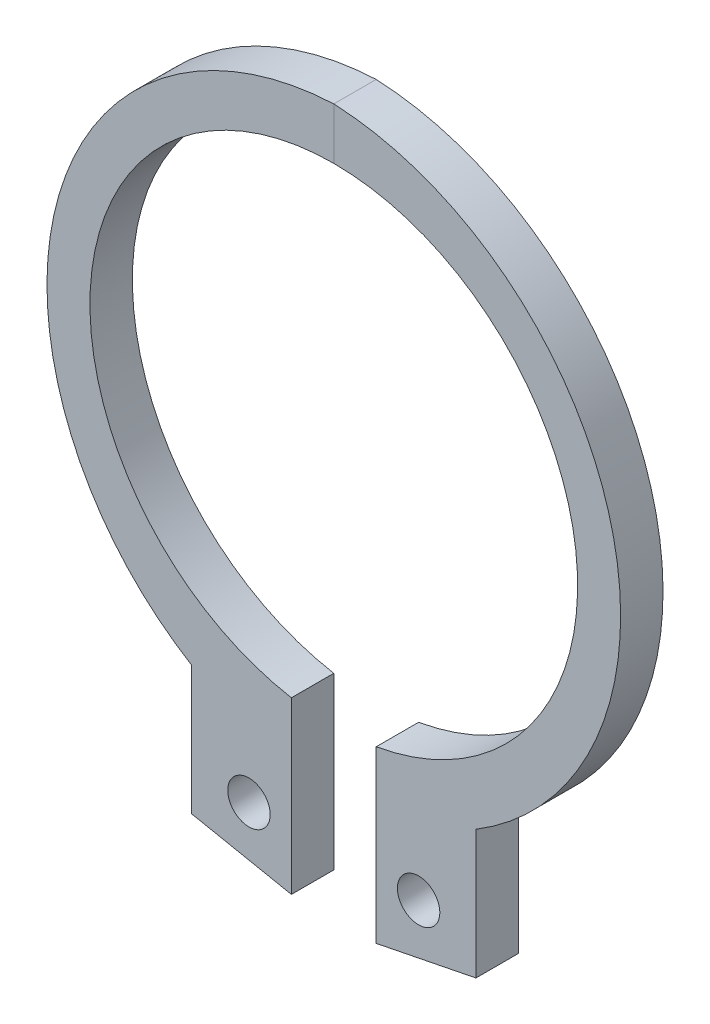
ISO-10303-21;
HEADER;
FILE_DESCRIPTION(('STEP AP214'),'2;1');
FILE_NAME('part.step','',(''),(''),'','','');
FILE_SCHEMA(('AUTOMOTIVE_DESIGN { 1 0 10303 214 1 1 1 1 }'));
ENDSEC;
DATA;
#1=APPLICATION_CONTEXT('core data for automotive mechanical design processes');
#2=APPLICATION_PROTOCOL_DEFINITION('international standard','automotive_design',2000,#1);
#3=PRODUCT_CONTEXT('',#1,'mechanical');
#4=PRODUCT('Part','Part','',(#3));
#5=PRODUCT_RELATED_PRODUCT_CATEGORY('part','',(#4));
#6=PRODUCT_DEFINITION_FORMATION('','',#4);
#7=PRODUCT_DEFINITION_CONTEXT('part definition',#1,'design');
#8=PRODUCT_DEFINITION('design','',#6,#7);
#9=PRODUCT_DEFINITION_SHAPE('','',#8);
#10=(LENGTH_UNIT() NAMED_UNIT(*) SI_UNIT(.MILLI.,.METRE.));
#11=(NAMED_UNIT(*) PLANE_ANGLE_UNIT() SI_UNIT($,.RADIAN.));
#12=(NAMED_UNIT(*) SI_UNIT($,.STERADIAN.) SOLID_ANGLE_UNIT());
#13=UNCERTAINTY_MEASURE_WITH_UNIT(LENGTH_MEASURE(1.E-05),#10,'distance_accuracy_value','');
#14=(GEOMETRIC_REPRESENTATION_CONTEXT(3) GLOBAL_UNCERTAINTY_ASSIGNED_CONTEXT((#13)) GLOBAL_UNIT_ASSIGNED_CONTEXT((#10,
#11,#12)) REPRESENTATION_CONTEXT('',''));
#15=CARTESIAN_POINT('',(0.,0.,0.));
#16=DIRECTION('',(0.,0.,1.));
#17=DIRECTION('',(1.,0.,0.));
#18=AXIS2_PLACEMENT_3D('',#15,#16,#17);
#19=CARTESIAN_POINT('',(-3.35179740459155,-9.2089876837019,1.));
#20=DIRECTION('',(0.195785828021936,0.980646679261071,0.));
#21=DIRECTION('',(-0.980646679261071,0.195785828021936,0.));
#22=AXIS2_PLACEMENT_3D('',#19,#20,#21);
#23=PLANE('',#22);
#24=DIRECTION('',(0.980646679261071,-0.195785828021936,0.));
#25=VECTOR('',#24,1.);
#26=CARTESIAN_POINT('',(-3.35179740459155,-9.2089876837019,0.));
#27=LINE('',#26,#25);
#28=CARTESIAN_POINT('',(-3.35179740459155,-9.2089876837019,0.));
#29=VERTEX_POINT('',#28);
#30=CARTESIAN_POINT('',(-1.,-9.67852336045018,0.));
#31=VERTEX_POINT('',#30);
#32=EDGE_CURVE('E127',#29,#31,#27,.T.);
#33=ORIENTED_EDGE('',*,*,#32,.T.);
#34=DIRECTION('',(0.,0.,1.));
#35=VECTOR('',#34,1.);
#36=CARTESIAN_POINT('',(-1.,-9.67852336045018,1.));
#37=LINE('',#36,#35);
#38=CARTESIAN_POINT('',(-1.,-9.67852336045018,1.));
#39=VERTEX_POINT('',#38);
#40=EDGE_CURVE('E32',#31,#39,#37,.T.);
#41=ORIENTED_EDGE('',*,*,#40,.T.);
#42=DIRECTION('',(0.980646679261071,-0.195785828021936,0.));
#43=VECTOR('',#42,1.);
#44=CARTESIAN_POINT('',(-3.35179740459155,-9.2089876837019,1.));
#45=LINE('',#44,#43);
#46=CARTESIAN_POINT('',(-3.35179740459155,-9.2089876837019,1.));
#47=VERTEX_POINT('',#46);
#48=EDGE_CURVE('E133',#47,#39,#45,.T.);
#49=ORIENTED_EDGE('',*,*,#48,.F.);
#50=DIRECTION('',(0.,0.,-1.));
#51=VECTOR('',#50,1.);
#52=CARTESIAN_POINT('',(-3.35179740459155,-9.2089876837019,1.));
#53=LINE('',#52,#51);
#54=EDGE_CURVE('E19',#47,#29,#53,.T.);
#55=ORIENTED_EDGE('',*,*,#54,.T.);
#56=EDGE_LOOP('',(#33,#41,#49,#55));
#57=FACE_BOUND('',#56,.T.);
#58=ADVANCED_FACE('F16',(#57),#23,.F.);
#59=CARTESIAN_POINT('',(0.,0.,1.));
#60=DIRECTION('',(0.,0.,-1.));
#61=DIRECTION('',(-1.,0.,0.));
#62=AXIS2_PLACEMENT_3D('',#59,#60,#61);
#63=CYLINDRICAL_SURFACE('',#62,5.75);
#64=DIRECTION('',(0.,0.,-1.));
#65=VECTOR('',#64,1.);
#66=CARTESIAN_POINT('',(-1.,-5.66237582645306,1.));
#67=LINE('',#66,#65);
#68=CARTESIAN_POINT('',(-1.,-5.66237582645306,0.));
#69=VERTEX_POINT('',#68);
#70=CARTESIAN_POINT('',(-1.,-5.66237582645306,1.));
#71=VERTEX_POINT('',#70);
#72=EDGE_CURVE('E110',#69,#71,#67,.F.);
#73=ORIENTED_EDGE('',*,*,#72,.F.);
#74=CARTESIAN_POINT('',(0.,0.,0.));
#75=DIRECTION('',(0.,0.,1.));
#76=DIRECTION('',(1.,0.,0.));
#77=AXIS2_PLACEMENT_3D('',#74,#75,#76);
#78=CIRCLE('',#77,5.75);
#79=CARTESIAN_POINT('',(0.,5.75,0.));
#80=VERTEX_POINT('',#79);
#81=EDGE_CURVE('E140',#80,#69,#78,.T.);
#82=ORIENTED_EDGE('',*,*,#81,.F.);
#83=DIRECTION('',(0.,0.,-1.));
#84=VECTOR('',#83,1.);
#85=CARTESIAN_POINT('',(0.,5.75,1.));
#86=LINE('',#85,#84);
#87=CARTESIAN_POINT('',(0.,5.75,1.));
#88=VERTEX_POINT('',#87);
#89=EDGE_CURVE('E11',#88,#80,#86,.T.);
#90=ORIENTED_EDGE('',*,*,#89,.F.);
#91=CARTESIAN_POINT('',(0.,0.,1.));
#92=DIRECTION('',(0.,0.,1.));
#93=DIRECTION('',(1.,0.,0.));
#94=AXIS2_PLACEMENT_3D('',#91,#92,#93);
#95=CIRCLE('',#94,5.75);
#96=EDGE_CURVE('E153',#88,#71,#95,.T.);
#97=ORIENTED_EDGE('',*,*,#96,.T.);
#98=EDGE_LOOP('',(#73,#82,#90,#97));
#99=FACE_BOUND('',#98,.T.);
#100=ADVANCED_FACE('F182',(#99),#63,.F.);
#101=CARTESIAN_POINT('',(0.321901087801,-0.112985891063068,1.));
#102=DIRECTION('',(0.,0.,-1.));
#103=DIRECTION('',(-1.,0.,0.));
#104=AXIS2_PLACEMENT_3D('',#101,#102,#103);
#105=CYLINDRICAL_SURFACE('',#104,7.08530201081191);
#106=CARTESIAN_POINT('',(0.321901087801,-0.112985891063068,0.));
#107=DIRECTION('',(0.,0.,1.));
#108=DIRECTION('',(1.,0.,0.));
#109=AXIS2_PLACEMENT_3D('',#106,#107,#108);
#110=CIRCLE('',#109,7.08530201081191);
#111=CARTESIAN_POINT('',(0.,6.965,0.));
#112=VERTEX_POINT('',#111);
#113=CARTESIAN_POINT('',(-3.35179740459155,-6.1714876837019,0.));
#114=VERTEX_POINT('',#113);
#115=EDGE_CURVE('E134',#112,#114,#110,.T.);
#116=ORIENTED_EDGE('',*,*,#115,.T.);
#117=DIRECTION('',(0.,0.,-1.));
#118=VECTOR('',#117,1.);
#119=CARTESIAN_POINT('',(-3.35179740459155,-6.1714876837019,1.));
#120=LINE('',#119,#118);
#121=CARTESIAN_POINT('',(-3.35179740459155,-6.1714876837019,1.));
#122=VERTEX_POINT('',#121);
#123=EDGE_CURVE('E159',#122,#114,#120,.T.);
#124=ORIENTED_EDGE('',*,*,#123,.F.);
#125=CARTESIAN_POINT('',(0.321901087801,-0.112985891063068,1.));
#126=DIRECTION('',(0.,0.,1.));
#127=DIRECTION('',(1.,0.,0.));
#128=AXIS2_PLACEMENT_3D('',#125,#126,#127);
#129=CIRCLE('',#128,7.08530201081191);
#130=CARTESIAN_POINT('',(0.,6.965,1.));
#131=VERTEX_POINT('',#130);
#132=EDGE_CURVE('E148',#131,#122,#129,.T.);
#133=ORIENTED_EDGE('',*,*,#132,.F.);
#134=DIRECTION('',(0.,0.,-1.));
#135=VECTOR('',#134,1.);
#136=CARTESIAN_POINT('',(0.,6.965,1.));
#137=LINE('',#136,#135);
#138=EDGE_CURVE('E24',#131,#112,#137,.T.);
#139=ORIENTED_EDGE('',*,*,#138,.T.);
#140=EDGE_LOOP('',(#116,#124,#133,#139));
#141=FACE_BOUND('',#140,.T.);
#142=ADVANCED_FACE('F173',(#141),#105,.T.);
#143=CARTESIAN_POINT('',(-3.35179740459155,-9.2089876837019,1.));
#144=DIRECTION('',(-1.,0.,0.));
#145=DIRECTION('',(0.,0.,1.));
#146=AXIS2_PLACEMENT_3D('',#143,#144,#145);
#147=PLANE('',#146);
#148=DIRECTION('',(0.,1.,0.));
#149=VECTOR('',#148,1.);
#150=CARTESIAN_POINT('',(-3.35179740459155,-9.2089876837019,0.));
#151=LINE('',#150,#149);
#152=EDGE_CURVE('E130',#29,#114,#151,.T.);
#153=ORIENTED_EDGE('',*,*,#152,.F.);
#154=ORIENTED_EDGE('',*,*,#54,.F.);
#155=DIRECTION('',(0.,1.,0.));
#156=VECTOR('',#155,1.);
#157=CARTESIAN_POINT('',(-3.35179740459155,-9.2089876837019,1.));
#158=LINE('',#157,#156);
#159=EDGE_CURVE('E145',#47,#122,#158,.T.);
#160=ORIENTED_EDGE('',*,*,#159,.T.);
#161=ORIENTED_EDGE('',*,*,#123,.T.);
#162=EDGE_LOOP('',(#153,#154,#160,#161));
#163=FACE_BOUND('',#162,.T.);
#164=ADVANCED_FACE('F170',(#163),#147,.T.);
#165=CARTESIAN_POINT('',(0.,0.,1.));
#166=DIRECTION('',(0.,0.,1.));
#167=DIRECTION('',(1.,0.,0.));
#168=AXIS2_PLACEMENT_3D('',#165,#166,#167);
#169=PLANE('',#168);
#170=CARTESIAN_POINT('',(-2.,-8.3,1.));
#171=DIRECTION('',(0.,0.,-1.));
#172=DIRECTION('',(0.,1.,0.));
#173=AXIS2_PLACEMENT_3D('',#170,#171,#172);
#174=CIRCLE('',#173,0.5);
#175=CARTESIAN_POINT('',(-2.,-7.8,1.));
#176=VERTEX_POINT('',#175);
#177=EDGE_CURVE('E261',#176,#176,#174,.T.);
#178=ORIENTED_EDGE('',*,*,#177,.T.);
#179=EDGE_LOOP('',(#178));
#180=FACE_BOUND('',#179,.T.);
#181=DIRECTION('',(0.,1.,0.));
#182=VECTOR('',#181,1.);
#183=CARTESIAN_POINT('',(-1.,-5.9,1.));
#184=LINE('',#183,#182);
#185=EDGE_CURVE('E218',#39,#71,#184,.T.);
#186=ORIENTED_EDGE('',*,*,#185,.T.);
#187=ORIENTED_EDGE('',*,*,#96,.F.);
#188=DIRECTION('',(0.,-1.,0.));
#189=VECTOR('',#188,1.);
#190=CARTESIAN_POINT('',(0.,6.965,1.));
#191=LINE('',#190,#189);
#192=EDGE_CURVE('E150',#131,#88,#191,.T.);
#193=ORIENTED_EDGE('',*,*,#192,.F.);
#194=ORIENTED_EDGE('',*,*,#132,.T.);
#195=ORIENTED_EDGE('',*,*,#159,.F.);
#196=ORIENTED_EDGE('',*,*,#48,.T.);
#197=EDGE_LOOP('',(#186,#187,#193,#194,#195,#196));
#198=FACE_BOUND('',#197,.T.);
#199=ADVANCED_FACE('F172',(#180,#198),#169,.T.);
#200=CARTESIAN_POINT('',(0.,0.,0.));
#201=DIRECTION('',(0.,0.,1.));
#202=DIRECTION('',(1.,0.,0.));
#203=AXIS2_PLACEMENT_3D('',#200,#201,#202);
#204=PLANE('',#203);
#205=CARTESIAN_POINT('',(-2.,-8.3,0.));
#206=DIRECTION('',(0.,0.,1.));
#207=DIRECTION('',(0.,1.,0.));
#208=AXIS2_PLACEMENT_3D('',#205,#206,#207);
#209=CIRCLE('',#208,0.5);
#210=CARTESIAN_POINT('',(-2.,-7.8,0.));
#211=VERTEX_POINT('',#210);
#212=EDGE_CURVE('E259',#211,#211,#209,.T.);
#213=ORIENTED_EDGE('',*,*,#212,.T.);
#214=EDGE_LOOP('',(#213));
#215=FACE_BOUND('',#214,.T.);
#216=ORIENTED_EDGE('',*,*,#81,.T.);
#217=DIRECTION('',(0.,-1.,0.));
#218=VECTOR('',#217,1.);
#219=CARTESIAN_POINT('',(-1.,-5.9,0.));
#220=LINE('',#219,#218);
#221=EDGE_CURVE('E100',#69,#31,#220,.T.);
#222=ORIENTED_EDGE('',*,*,#221,.T.);
#223=ORIENTED_EDGE('',*,*,#32,.F.);
#224=ORIENTED_EDGE('',*,*,#152,.T.);
#225=ORIENTED_EDGE('',*,*,#115,.F.);
#226=DIRECTION('',(0.,-1.,0.));
#227=VECTOR('',#226,1.);
#228=CARTESIAN_POINT('',(0.,6.965,0.));
#229=LINE('',#228,#227);
#230=EDGE_CURVE('E137',#112,#80,#229,.T.);
#231=ORIENTED_EDGE('',*,*,#230,.T.);
#232=EDGE_LOOP('',(#216,#222,#223,#224,#225,#231));
#233=FACE_BOUND('',#232,.T.);
#234=ADVANCED_FACE('F168',(#215,#233),#204,.F.);
#235=CARTESIAN_POINT('',(3.35179740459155,-9.2089876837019,0.));
#236=DIRECTION('',(-0.195785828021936,0.980646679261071,0.));
#237=DIRECTION('',(0.980646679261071,0.195785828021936,0.));
#238=AXIS2_PLACEMENT_3D('',#235,#236,#237);
#239=PLANE('',#238);
#240=DIRECTION('',(-0.980646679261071,-0.195785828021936,0.));
#241=VECTOR('',#240,1.);
#242=CARTESIAN_POINT('',(3.35179740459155,-9.2089876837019,1.));
#243=LINE('',#242,#241);
#244=CARTESIAN_POINT('',(3.35179740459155,-9.2089876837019,1.));
#245=VERTEX_POINT('',#244);
#246=CARTESIAN_POINT('',(1.,-9.67852336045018,1.));
#247=VERTEX_POINT('',#246);
#248=EDGE_CURVE('E109',#245,#247,#243,.T.);
#249=ORIENTED_EDGE('',*,*,#248,.T.);
#250=DIRECTION('',(0.,0.,-1.));
#251=VECTOR('',#250,1.);
#252=CARTESIAN_POINT('',(1.,-9.67852336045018,0.));
#253=LINE('',#252,#251);
#254=CARTESIAN_POINT('',(1.,-9.67852336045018,0.));
#255=VERTEX_POINT('',#254);
#256=EDGE_CURVE('E40',#247,#255,#253,.T.);
#257=ORIENTED_EDGE('',*,*,#256,.T.);
#258=DIRECTION('',(-0.980646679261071,-0.195785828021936,0.));
#259=VECTOR('',#258,1.);
#260=CARTESIAN_POINT('',(3.35179740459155,-9.2089876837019,0.));
#261=LINE('',#260,#259);
#262=CARTESIAN_POINT('',(3.35179740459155,-9.2089876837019,0.));
#263=VERTEX_POINT('',#262);
#264=EDGE_CURVE('E106',#263,#255,#261,.T.);
#265=ORIENTED_EDGE('',*,*,#264,.F.);
#266=DIRECTION('',(0.,0.,1.));
#267=VECTOR('',#266,1.);
#268=CARTESIAN_POINT('',(3.35179740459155,-9.2089876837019,0.));
#269=LINE('',#268,#267);
#270=EDGE_CURVE('E128',#263,#245,#269,.T.);
#271=ORIENTED_EDGE('',*,*,#270,.T.);
#272=EDGE_LOOP('',(#249,#257,#265,#271));
#273=FACE_BOUND('',#272,.T.);
#274=ADVANCED_FACE('F105',(#273),#239,.F.);
#275=CARTESIAN_POINT('',(0.,0.,0.));
#276=DIRECTION('',(0.,0.,1.));
#277=DIRECTION('',(1.,0.,0.));
#278=AXIS2_PLACEMENT_3D('',#275,#276,#277);
#279=CYLINDRICAL_SURFACE('',#278,5.75);
#280=DIRECTION('',(0.,0.,1.));
#281=VECTOR('',#280,1.);
#282=CARTESIAN_POINT('',(1.,-5.66237582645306,0.));
#283=LINE('',#282,#281);
#284=CARTESIAN_POINT('',(1.,-5.66237582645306,1.));
#285=VERTEX_POINT('',#284);
#286=CARTESIAN_POINT('',(1.,-5.66237582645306,0.));
#287=VERTEX_POINT('',#286);
#288=EDGE_CURVE('E95',#285,#287,#283,.F.);
#289=ORIENTED_EDGE('',*,*,#288,.F.);
#290=CARTESIAN_POINT('',(0.,0.,1.));
#291=DIRECTION('',(0.,0.,-1.));
#292=DIRECTION('',(-1.,0.,0.));
#293=AXIS2_PLACEMENT_3D('',#290,#291,#292);
#294=CIRCLE('',#293,5.75);
#295=EDGE_CURVE('E210',#88,#285,#294,.T.);
#296=ORIENTED_EDGE('',*,*,#295,.F.);
#297=ORIENTED_EDGE('',*,*,#89,.T.);
#298=CARTESIAN_POINT('',(0.,0.,0.));
#299=DIRECTION('',(0.,0.,-1.));
#300=DIRECTION('',(-1.,0.,0.));
#301=AXIS2_PLACEMENT_3D('',#298,#299,#300);
#302=CIRCLE('',#301,5.75);
#303=EDGE_CURVE('E115',#80,#287,#302,.T.);
#304=ORIENTED_EDGE('',*,*,#303,.T.);
#305=EDGE_LOOP('',(#289,#296,#297,#304));
#306=FACE_BOUND('',#305,.T.);
#307=ADVANCED_FACE('F247',(#306),#279,.F.);
#308=CARTESIAN_POINT('',(-0.321901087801,-0.112985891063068,0.));
#309=DIRECTION('',(0.,0.,1.));
#310=DIRECTION('',(1.,0.,0.));
#311=AXIS2_PLACEMENT_3D('',#308,#309,#310);
#312=CYLINDRICAL_SURFACE('',#311,7.08530201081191);
#313=CARTESIAN_POINT('',(-0.321901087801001,-0.112985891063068,1.));
#314=DIRECTION('',(0.,0.,-1.));
#315=DIRECTION('',(-1.,0.,0.));
#316=AXIS2_PLACEMENT_3D('',#313,#314,#315);
#317=CIRCLE('',#316,7.08530201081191);
#318=CARTESIAN_POINT('',(3.35179740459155,-6.1714876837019,1.));
#319=VERTEX_POINT('',#318);
#320=EDGE_CURVE('E121',#131,#319,#317,.T.);
#321=ORIENTED_EDGE('',*,*,#320,.T.);
#322=DIRECTION('',(0.,0.,1.));
#323=VECTOR('',#322,1.);
#324=CARTESIAN_POINT('',(3.35179740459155,-6.1714876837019,0.));
#325=LINE('',#324,#323);
#326=CARTESIAN_POINT('',(3.35179740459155,-6.1714876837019,0.));
#327=VERTEX_POINT('',#326);
#328=EDGE_CURVE('E125',#327,#319,#325,.T.);
#329=ORIENTED_EDGE('',*,*,#328,.F.);
#330=CARTESIAN_POINT('',(-0.321901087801,-0.112985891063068,0.));
#331=DIRECTION('',(0.,0.,-1.));
#332=DIRECTION('',(-1.,0.,0.));
#333=AXIS2_PLACEMENT_3D('',#330,#331,#332);
#334=CIRCLE('',#333,7.08530201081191);
#335=EDGE_CURVE('E118',#112,#327,#334,.T.);
#336=ORIENTED_EDGE('',*,*,#335,.F.);
#337=ORIENTED_EDGE('',*,*,#138,.F.);
#338=EDGE_LOOP('',(#321,#329,#336,#337));
#339=FACE_BOUND('',#338,.T.);
#340=ADVANCED_FACE('F205',(#339),#312,.T.);
#341=CARTESIAN_POINT('',(3.35179740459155,-9.2089876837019,0.));
#342=DIRECTION('',(1.,0.,0.));
#343=DIRECTION('',(0.,0.,-1.));
#344=AXIS2_PLACEMENT_3D('',#341,#342,#343);
#345=PLANE('',#344);
#346=DIRECTION('',(0.,1.,0.));
#347=VECTOR('',#346,1.);
#348=CARTESIAN_POINT('',(3.35179740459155,-9.2089876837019,1.));
#349=LINE('',#348,#347);
#350=EDGE_CURVE('E116',#245,#319,#349,.T.);
#351=ORIENTED_EDGE('',*,*,#350,.F.);
#352=ORIENTED_EDGE('',*,*,#270,.F.);
#353=DIRECTION('',(0.,1.,0.));
#354=VECTOR('',#353,1.);
#355=CARTESIAN_POINT('',(3.35179740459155,-9.2089876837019,0.));
#356=LINE('',#355,#354);
#357=EDGE_CURVE('E114',#263,#327,#356,.T.);
#358=ORIENTED_EDGE('',*,*,#357,.T.);
#359=ORIENTED_EDGE('',*,*,#328,.T.);
#360=EDGE_LOOP('',(#351,#352,#358,#359));
#361=FACE_BOUND('',#360,.T.);
#362=ADVANCED_FACE('F217',(#361),#345,.T.);
#363=CARTESIAN_POINT('',(0.,0.,0.));
#364=DIRECTION('',(0.,0.,-1.));
#365=DIRECTION('',(-1.,0.,0.));
#366=AXIS2_PLACEMENT_3D('',#363,#364,#365);
#367=PLANE('',#366);
#368=CARTESIAN_POINT('',(2.,-8.3,0.));
#369=DIRECTION('',(0.,0.,1.));
#370=DIRECTION('',(0.,1.,0.));
#371=AXIS2_PLACEMENT_3D('',#368,#369,#370);
#372=CIRCLE('',#371,0.5);
#373=CARTESIAN_POINT('',(2.,-7.8,0.));
#374=VERTEX_POINT('',#373);
#375=EDGE_CURVE('E267',#374,#374,#372,.T.);
#376=ORIENTED_EDGE('',*,*,#375,.T.);
#377=EDGE_LOOP('',(#376));
#378=FACE_BOUND('',#377,.T.);
#379=DIRECTION('',(0.,1.,0.));
#380=VECTOR('',#379,1.);
#381=CARTESIAN_POINT('',(1.,-5.9,0.));
#382=LINE('',#381,#380);
#383=EDGE_CURVE('E92',#255,#287,#382,.T.);
#384=ORIENTED_EDGE('',*,*,#383,.T.);
#385=ORIENTED_EDGE('',*,*,#303,.F.);
#386=ORIENTED_EDGE('',*,*,#230,.F.);
#387=ORIENTED_EDGE('',*,*,#335,.T.);
#388=ORIENTED_EDGE('',*,*,#357,.F.);
#389=ORIENTED_EDGE('',*,*,#264,.T.);
#390=EDGE_LOOP('',(#384,#385,#386,#387,#388,#389));
#391=FACE_BOUND('',#390,.T.);
#392=ADVANCED_FACE('F112',(#378,#391),#367,.T.);
#393=CARTESIAN_POINT('',(0.,0.,1.));
#394=DIRECTION('',(0.,0.,-1.));
#395=DIRECTION('',(-1.,0.,0.));
#396=AXIS2_PLACEMENT_3D('',#393,#394,#395);
#397=PLANE('',#396);
#398=CARTESIAN_POINT('',(2.,-8.3,1.));
#399=DIRECTION('',(0.,0.,-1.));
#400=DIRECTION('',(0.,1.,0.));
#401=AXIS2_PLACEMENT_3D('',#398,#399,#400);
#402=CIRCLE('',#401,0.5);
#403=CARTESIAN_POINT('',(2.,-7.8,1.));
#404=VERTEX_POINT('',#403);
#405=EDGE_CURVE('E262',#404,#404,#402,.T.);
#406=ORIENTED_EDGE('',*,*,#405,.T.);
#407=EDGE_LOOP('',(#406));
#408=FACE_BOUND('',#407,.T.);
#409=ORIENTED_EDGE('',*,*,#295,.T.);
#410=DIRECTION('',(0.,-1.,0.));
#411=VECTOR('',#410,1.);
#412=CARTESIAN_POINT('',(1.,-5.9,1.));
#413=LINE('',#412,#411);
#414=EDGE_CURVE('E99',#285,#247,#413,.T.);
#415=ORIENTED_EDGE('',*,*,#414,.T.);
#416=ORIENTED_EDGE('',*,*,#248,.F.);
#417=ORIENTED_EDGE('',*,*,#350,.T.);
#418=ORIENTED_EDGE('',*,*,#320,.F.);
#419=ORIENTED_EDGE('',*,*,#192,.T.);
#420=EDGE_LOOP('',(#409,#415,#416,#417,#418,#419));
#421=FACE_BOUND('',#420,.T.);
#422=ADVANCED_FACE('F208',(#408,#421),#397,.F.);
#423=CARTESIAN_POINT('',(1.,-5.9,0.));
#424=DIRECTION('',(1.,0.,0.));
#425=DIRECTION('',(0.,0.,-1.));
#426=AXIS2_PLACEMENT_3D('',#423,#424,#425);
#427=PLANE('',#426);
#428=ORIENTED_EDGE('',*,*,#414,.F.);
#429=ORIENTED_EDGE('',*,*,#288,.T.);
#430=ORIENTED_EDGE('',*,*,#383,.F.);
#431=ORIENTED_EDGE('',*,*,#256,.F.);
#432=EDGE_LOOP('',(#428,#429,#430,#431));
#433=FACE_BOUND('',#432,.T.);
#434=ADVANCED_FACE('F93',(#433),#427,.F.);
#435=CARTESIAN_POINT('',(-1.,-5.9,0.));
#436=DIRECTION('',(-1.,0.,0.));
#437=DIRECTION('',(0.,0.,1.));
#438=AXIS2_PLACEMENT_3D('',#435,#436,#437);
#439=PLANE('',#438);
#440=ORIENTED_EDGE('',*,*,#221,.F.);
#441=ORIENTED_EDGE('',*,*,#72,.T.);
#442=ORIENTED_EDGE('',*,*,#185,.F.);
#443=ORIENTED_EDGE('',*,*,#40,.F.);
#444=EDGE_LOOP('',(#440,#441,#442,#443));
#445=FACE_BOUND('',#444,.T.);
#446=ADVANCED_FACE('F224',(#445),#439,.F.);
#447=CARTESIAN_POINT('',(-2.,-8.3,0.));
#448=DIRECTION('',(0.,0.,1.));
#449=DIRECTION('',(0.,1.,0.));
#450=AXIS2_PLACEMENT_3D('',#447,#448,#449);
#451=CYLINDRICAL_SURFACE('',#450,0.5);
#452=ORIENTED_EDGE('',*,*,#177,.F.);
#453=EDGE_LOOP('',(#452));
#454=FACE_BOUND('',#453,.T.);
#455=ORIENTED_EDGE('',*,*,#212,.F.);
#456=EDGE_LOOP('',(#455));
#457=FACE_BOUND('',#456,.T.);
#458=ADVANCED_FACE('F226',(#454,#457),#451,.F.);
#459=CARTESIAN_POINT('',(2.,-8.3,0.));
#460=DIRECTION('',(0.,0.,1.));
#461=DIRECTION('',(0.,1.,0.));
#462=AXIS2_PLACEMENT_3D('',#459,#460,#461);
#463=CYLINDRICAL_SURFACE('',#462,0.5);
#464=ORIENTED_EDGE('',*,*,#405,.F.);
#465=EDGE_LOOP('',(#464));
#466=FACE_BOUND('',#465,.T.);
#467=ORIENTED_EDGE('',*,*,#375,.F.);
#468=EDGE_LOOP('',(#467));
#469=FACE_BOUND('',#468,.T.);
#470=ADVANCED_FACE('F232',(#466,#469),#463,.F.);
#471=CLOSED_SHELL('',(#58,#100,#142,#164,#199,#234,#274,#307,#340,#362,#392,#422,#434,#446,#458,#470));
#472=MANIFOLD_SOLID_BREP('B1',#471);
#473=ADVANCED_BREP_SHAPE_REPRESENTATION('',(#18,#472),#14);
#474=SHAPE_DEFINITION_REPRESENTATION(#9,#473);
ENDSEC;
END-ISO-10303-21;
